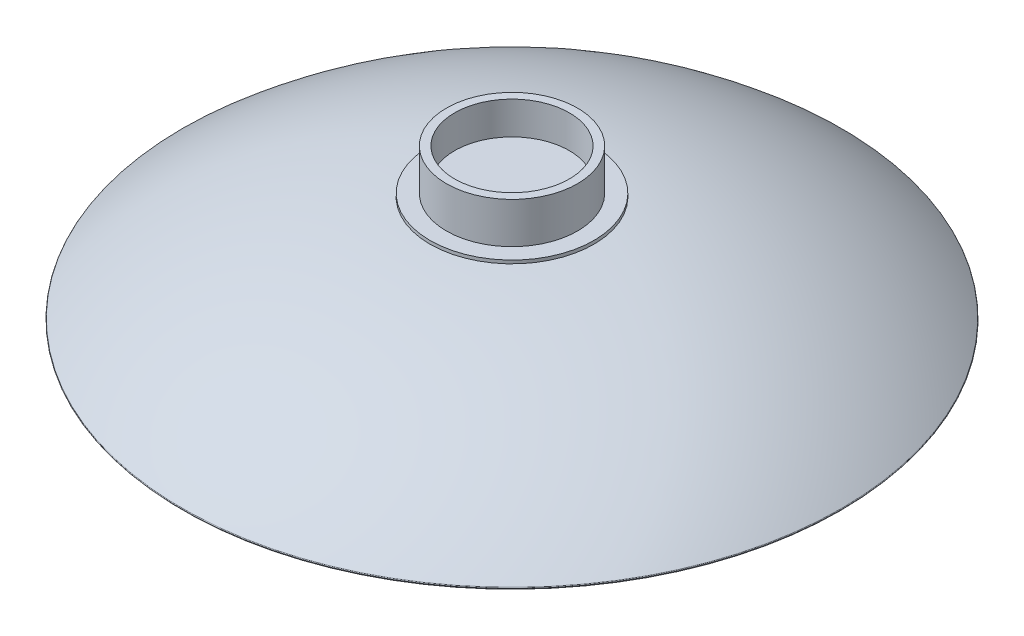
from build123d import *

# Parameters (mm, degrees)
CROQUIS2_R              = 50
SALIENTE_EXTRUIR1_DEPTH = 2
CROQUIS3_R              = 50
SALIENTE_EXTRUIR2_DEPTH = 20
CROQUIS4_R              = 50
SALIENTE_EXTRUIR3_DEPTH = 15
REDONDEO2_R             = 10
CROQUIS5_R              = 50
SALIENTE_EXTRUIR4_DEPTH = 2
CROQUIS10_R             = 40
SALIENTE_EXTRUIR8_DEPTH = 25
CROQUIS12_R             = 35
CORTAR_EXTRUIR1_DEPTH   = 20
REDONDEO3_R             = 0.5


with BuildPart() as part:
    # Croquis2 → Saliente-Extruir1 (new body)
    with BuildSketch(Plane.XZ.offset(-27)):
        with Locations(Location((0, 0, 0), (0, 0, 270))):
            Circle(CROQUIS2_R)
    extrude(amount=SALIENTE_EXTRUIR1_DEPTH)


with BuildPart() as body_2:
    # Croquis3 → Saliente-Extruir2 (new body)
    with BuildSketch(Plane.XZ.offset(-25)):
        with Locations(Location((0, 0, 0), (0, 0, 270))):
            Circle(CROQUIS3_R)
    extrude(amount=SALIENTE_EXTRUIR2_DEPTH)


with BuildPart() as body_3:
    # Croquis4 → Saliente-Extruir3 (new body)
    with BuildSketch(Plane.XZ.offset(-5)):
        with Locations(Location((0, 0, 0), (0, 0, 270))):
            Circle(CROQUIS4_R)
    extrude(amount=SALIENTE_EXTRUIR3_DEPTH)

    # Redondeo2
    redondeo2_edges = [body_3.edges().sort_by_distance(p)[0] for p in [
        (0, -10, 50),
    ]]
    fillet(redondeo2_edges, radius=REDONDEO2_R)


with BuildPart() as body_4:
    # Croquis5 → Saliente-Extruir4 (new body)
    with BuildSketch(Plane(origin=(0, 30, 0), x_dir=(1, 0, 0), z_dir=(0, 1, 0))):
        with Locations(Location((0, 0, 0), (0, 0, 270))):
            Circle(CROQUIS5_R)
    extrude(amount=SALIENTE_EXTRUIR4_DEPTH)


with BuildPart() as body_5:
    # Croquis10 → Saliente-Extruir8 (new body)
    with BuildSketch(Plane(origin=(0, 32, 0), x_dir=(1, 0, 0), z_dir=(0, 1, 0))):
        with Locations(Location((0, 0, 0), (0, 0, 270))):
            Circle(CROQUIS10_R)
    extrude(amount=SALIENTE_EXTRUIR8_DEPTH)

    # Croquis12 → Cortar-Extruir1 (cut)
    with BuildSketch(Plane(origin=(0, 57, 0), x_dir=(1, 0, 0), z_dir=(0, 1, 0))):
        with Locations(Location((0, 0, 0), (0, 0, 270))):
            Circle(CROQUIS12_R)
    extrude(amount=-CORTAR_EXTRUIR1_DEPTH, mode=Mode.SUBTRACT)


with BuildPart() as body_6:
    # Croquis11 → Revoluci_n1 (revolve)
    with BuildSketch(Plane.XY, mode=Mode.PRIVATE) as revoluci_n1_sk:
        with BuildLine():
            Line((200, -36), (201.306581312, -34.485785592))
            ThreePointArc((201.306581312, -34.485785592), (107.194443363, 18.000180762), (0, 29.010289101))
            Line((0, 29.010289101), (0, 27))
            ThreePointArc((0, 27), (106.49631808, 16.123232), (200, -36))
        make_face()
    revolve(revoluci_n1_sk.sketch.rotate(Axis((0, 27, 0), (0, -1, 0)), 180), axis=Axis((0, 27, 0), (0, -1, 0)))

    # Redondeo3
    redondeo3_edges = [body_6.edges().sort_by_distance(p)[0] for p in [
        (200, -36, 0),
        (201.306581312, -34.485785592, 0),
    ]]
    fillet(redondeo3_edges, radius=REDONDEO3_R)


solid = Compound([part.part, body_2.part, body_3.part, body_4.part, body_5.part, body_6.part])
